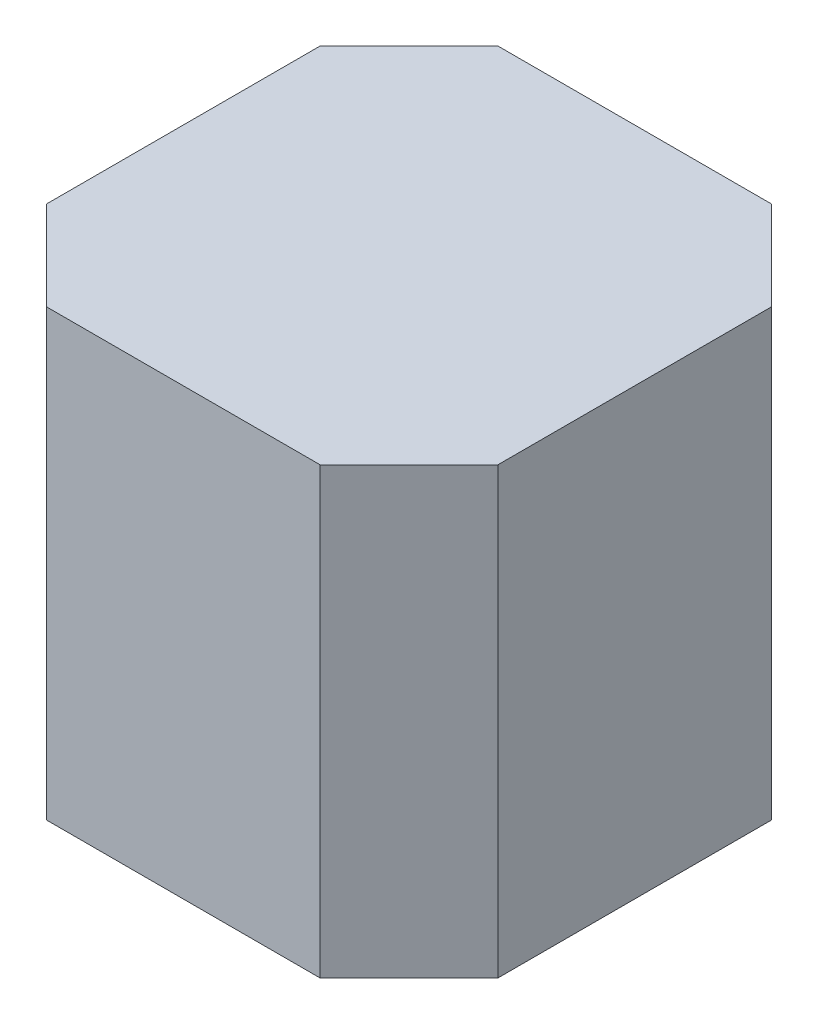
ISO-10303-21;
HEADER;
FILE_DESCRIPTION(('STEP AP214'),'2;1');
FILE_NAME('part.step','',(''),(''),'','','');
FILE_SCHEMA(('AUTOMOTIVE_DESIGN { 1 0 10303 214 1 1 1 1 }'));
ENDSEC;
DATA;
#1=APPLICATION_CONTEXT('core data for automotive mechanical design processes');
#2=APPLICATION_PROTOCOL_DEFINITION('international standard','automotive_design',2000,#1);
#3=PRODUCT_CONTEXT('',#1,'mechanical');
#4=PRODUCT('Part','Part','',(#3));
#5=PRODUCT_RELATED_PRODUCT_CATEGORY('part','',(#4));
#6=PRODUCT_DEFINITION_FORMATION('','',#4);
#7=PRODUCT_DEFINITION_CONTEXT('part definition',#1,'design');
#8=PRODUCT_DEFINITION('design','',#6,#7);
#9=PRODUCT_DEFINITION_SHAPE('','',#8);
#10=(LENGTH_UNIT() NAMED_UNIT(*) SI_UNIT(.MILLI.,.METRE.));
#11=(NAMED_UNIT(*) PLANE_ANGLE_UNIT() SI_UNIT($,.RADIAN.));
#12=(NAMED_UNIT(*) SI_UNIT($,.STERADIAN.) SOLID_ANGLE_UNIT());
#13=UNCERTAINTY_MEASURE_WITH_UNIT(LENGTH_MEASURE(1.E-05),#10,'distance_accuracy_value','');
#14=(GEOMETRIC_REPRESENTATION_CONTEXT(3) GLOBAL_UNCERTAINTY_ASSIGNED_CONTEXT((#13)) GLOBAL_UNIT_ASSIGNED_CONTEXT((#10,
#11,#12)) REPRESENTATION_CONTEXT('',''));
#15=CARTESIAN_POINT('',(0.,0.,0.));
#16=DIRECTION('',(0.,0.,1.));
#17=DIRECTION('',(1.,0.,0.));
#18=AXIS2_PLACEMENT_3D('',#15,#16,#17);
#19=CARTESIAN_POINT('',(1.27,2.5,-1.27));
#20=DIRECTION('',(-1.,0.,0.));
#21=DIRECTION('',(0.,0.,1.));
#22=AXIS2_PLACEMENT_3D('',#19,#20,#21);
#23=PLANE('',#22);
#24=DIRECTION('',(0.,0.,-1.));
#25=VECTOR('',#24,1.);
#26=CARTESIAN_POINT('',(1.27,2.5,-1.27));
#27=LINE('',#26,#25);
#28=CARTESIAN_POINT('',(1.27,2.5,0.77));
#29=VERTEX_POINT('',#28);
#30=CARTESIAN_POINT('',(1.27,2.5,-0.769999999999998));
#31=VERTEX_POINT('',#30);
#32=EDGE_CURVE('E132',#29,#31,#27,.T.);
#33=ORIENTED_EDGE('',*,*,#32,.F.);
#34=DIRECTION('',(0.,-1.,0.));
#35=VECTOR('',#34,1.);
#36=CARTESIAN_POINT('',(1.27,2.5,0.77));
#37=LINE('',#36,#35);
#38=CARTESIAN_POINT('',(1.27,0.,0.77));
#39=VERTEX_POINT('',#38);
#40=EDGE_CURVE('E11',#29,#39,#37,.T.);
#41=ORIENTED_EDGE('',*,*,#40,.T.);
#42=DIRECTION('',(0.,0.,-1.));
#43=VECTOR('',#42,1.);
#44=CARTESIAN_POINT('',(1.27,0.,-1.27));
#45=LINE('',#44,#43);
#46=CARTESIAN_POINT('',(1.27,0.,-0.769999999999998));
#47=VERTEX_POINT('',#46);
#48=EDGE_CURVE('E134',#39,#47,#45,.T.);
#49=ORIENTED_EDGE('',*,*,#48,.T.);
#50=DIRECTION('',(0.,1.,0.));
#51=VECTOR('',#50,1.);
#52=CARTESIAN_POINT('',(1.27,2.5,-0.769999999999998));
#53=LINE('',#52,#51);
#54=EDGE_CURVE('E45',#47,#31,#53,.T.);
#55=ORIENTED_EDGE('',*,*,#54,.T.);
#56=EDGE_LOOP('',(#33,#41,#49,#55));
#57=FACE_BOUND('',#56,.T.);
#58=ADVANCED_FACE('F36',(#57),#23,.F.);
#59=CARTESIAN_POINT('',(-1.27,2.5,-1.27));
#60=DIRECTION('',(0.,0.,1.));
#61=DIRECTION('',(1.,0.,0.));
#62=AXIS2_PLACEMENT_3D('',#59,#60,#61);
#63=PLANE('',#62);
#64=DIRECTION('',(-1.,0.,0.));
#65=VECTOR('',#64,1.);
#66=CARTESIAN_POINT('',(-1.27,0.,-1.27));
#67=LINE('',#66,#65);
#68=CARTESIAN_POINT('',(0.77,0.,-1.27));
#69=VERTEX_POINT('',#68);
#70=CARTESIAN_POINT('',(-0.769999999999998,0.,-1.27));
#71=VERTEX_POINT('',#70);
#72=EDGE_CURVE('E130',#69,#71,#67,.T.);
#73=ORIENTED_EDGE('',*,*,#72,.T.);
#74=DIRECTION('',(0.,1.,0.));
#75=VECTOR('',#74,1.);
#76=CARTESIAN_POINT('',(-0.769999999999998,2.5,-1.27));
#77=LINE('',#76,#75);
#78=CARTESIAN_POINT('',(-0.769999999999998,2.5,-1.27));
#79=VERTEX_POINT('',#78);
#80=EDGE_CURVE('E109',#71,#79,#77,.T.);
#81=ORIENTED_EDGE('',*,*,#80,.T.);
#82=DIRECTION('',(-1.,0.,0.));
#83=VECTOR('',#82,1.);
#84=CARTESIAN_POINT('',(-1.27,2.5,-1.27));
#85=LINE('',#84,#83);
#86=CARTESIAN_POINT('',(0.77,2.5,-1.27));
#87=VERTEX_POINT('',#86);
#88=EDGE_CURVE('E170',#87,#79,#85,.T.);
#89=ORIENTED_EDGE('',*,*,#88,.F.);
#90=DIRECTION('',(0.,-1.,0.));
#91=VECTOR('',#90,1.);
#92=CARTESIAN_POINT('',(0.77,2.5,-1.27));
#93=LINE('',#92,#91);
#94=EDGE_CURVE('E114',#87,#69,#93,.T.);
#95=ORIENTED_EDGE('',*,*,#94,.T.);
#96=EDGE_LOOP('',(#73,#81,#89,#95));
#97=FACE_BOUND('',#96,.T.);
#98=ADVANCED_FACE('F174',(#97),#63,.F.);
#99=CARTESIAN_POINT('',(-1.27,2.5,-1.27));
#100=DIRECTION('',(1.,0.,0.));
#101=DIRECTION('',(0.,0.,-1.));
#102=AXIS2_PLACEMENT_3D('',#99,#100,#101);
#103=PLANE('',#102);
#104=DIRECTION('',(0.,0.,1.));
#105=VECTOR('',#104,1.);
#106=CARTESIAN_POINT('',(-1.27,2.5,-1.27));
#107=LINE('',#106,#105);
#108=CARTESIAN_POINT('',(-1.27,2.5,-0.77));
#109=VERTEX_POINT('',#108);
#110=CARTESIAN_POINT('',(-1.27,2.5,0.769999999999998));
#111=VERTEX_POINT('',#110);
#112=EDGE_CURVE('E123',#109,#111,#107,.T.);
#113=ORIENTED_EDGE('',*,*,#112,.F.);
#114=DIRECTION('',(0.,-1.,0.));
#115=VECTOR('',#114,1.);
#116=CARTESIAN_POINT('',(-1.27,2.5,-0.77));
#117=LINE('',#116,#115);
#118=CARTESIAN_POINT('',(-1.27,0.,-0.77));
#119=VERTEX_POINT('',#118);
#120=EDGE_CURVE('E108',#109,#119,#117,.T.);
#121=ORIENTED_EDGE('',*,*,#120,.T.);
#122=DIRECTION('',(0.,0.,1.));
#123=VECTOR('',#122,1.);
#124=CARTESIAN_POINT('',(-1.27,0.,-1.27));
#125=LINE('',#124,#123);
#126=CARTESIAN_POINT('',(-1.27,0.,0.769999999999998));
#127=VERTEX_POINT('',#126);
#128=EDGE_CURVE('E121',#119,#127,#125,.T.);
#129=ORIENTED_EDGE('',*,*,#128,.T.);
#130=DIRECTION('',(0.,1.,0.));
#131=VECTOR('',#130,1.);
#132=CARTESIAN_POINT('',(-1.27,2.5,0.769999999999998));
#133=LINE('',#132,#131);
#134=EDGE_CURVE('E125',#127,#111,#133,.T.);
#135=ORIENTED_EDGE('',*,*,#134,.T.);
#136=EDGE_LOOP('',(#113,#121,#129,#135));
#137=FACE_BOUND('',#136,.T.);
#138=ADVANCED_FACE('F120',(#137),#103,.F.);
#139=CARTESIAN_POINT('',(-1.27,2.5,1.27));
#140=DIRECTION('',(0.,0.,-1.));
#141=DIRECTION('',(-1.,0.,0.));
#142=AXIS2_PLACEMENT_3D('',#139,#140,#141);
#143=PLANE('',#142);
#144=DIRECTION('',(1.,0.,0.));
#145=VECTOR('',#144,1.);
#146=CARTESIAN_POINT('',(-1.27,2.5,1.27));
#147=LINE('',#146,#145);
#148=CARTESIAN_POINT('',(-0.77,2.5,1.27));
#149=VERTEX_POINT('',#148);
#150=CARTESIAN_POINT('',(0.769999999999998,2.5,1.27));
#151=VERTEX_POINT('',#150);
#152=EDGE_CURVE('E138',#149,#151,#147,.T.);
#153=ORIENTED_EDGE('',*,*,#152,.F.);
#154=DIRECTION('',(0.,-1.,0.));
#155=VECTOR('',#154,1.);
#156=CARTESIAN_POINT('',(-0.77,2.5,1.27));
#157=LINE('',#156,#155);
#158=CARTESIAN_POINT('',(-0.77,0.,1.27));
#159=VERTEX_POINT('',#158);
#160=EDGE_CURVE('E155',#149,#159,#157,.T.);
#161=ORIENTED_EDGE('',*,*,#160,.T.);
#162=DIRECTION('',(1.,0.,0.));
#163=VECTOR('',#162,1.);
#164=CARTESIAN_POINT('',(-1.27,0.,1.27));
#165=LINE('',#164,#163);
#166=CARTESIAN_POINT('',(0.769999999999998,0.,1.27));
#167=VERTEX_POINT('',#166);
#168=EDGE_CURVE('E129',#159,#167,#165,.T.);
#169=ORIENTED_EDGE('',*,*,#168,.T.);
#170=DIRECTION('',(0.,1.,0.));
#171=VECTOR('',#170,1.);
#172=CARTESIAN_POINT('',(0.769999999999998,2.5,1.27));
#173=LINE('',#172,#171);
#174=EDGE_CURVE('E52',#167,#151,#173,.T.);
#175=ORIENTED_EDGE('',*,*,#174,.T.);
#176=EDGE_LOOP('',(#153,#161,#169,#175));
#177=FACE_BOUND('',#176,.T.);
#178=ADVANCED_FACE('F181',(#177),#143,.F.);
#179=CARTESIAN_POINT('',(0.,2.5,0.));
#180=DIRECTION('',(0.,1.,0.));
#181=DIRECTION('',(0.,0.,1.));
#182=AXIS2_PLACEMENT_3D('',#179,#180,#181);
#183=PLANE('',#182);
#184=ORIENTED_EDGE('',*,*,#88,.T.);
#185=DIRECTION('',(0.707106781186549,0.,-0.707106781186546));
#186=VECTOR('',#185,1.);
#187=CARTESIAN_POINT('',(-1.02,2.5,-1.02));
#188=LINE('',#187,#186);
#189=EDGE_CURVE('E152',#79,#109,#188,.F.);
#190=ORIENTED_EDGE('',*,*,#189,.T.);
#191=ORIENTED_EDGE('',*,*,#112,.T.);
#192=DIRECTION('',(-0.707106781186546,0.,-0.707106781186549));
#193=VECTOR('',#192,1.);
#194=CARTESIAN_POINT('',(-1.02,2.5,1.02));
#195=LINE('',#194,#193);
#196=EDGE_CURVE('E59',#111,#149,#195,.F.);
#197=ORIENTED_EDGE('',*,*,#196,.T.);
#198=ORIENTED_EDGE('',*,*,#152,.T.);
#199=DIRECTION('',(-0.707106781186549,0.,0.707106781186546));
#200=VECTOR('',#199,1.);
#201=CARTESIAN_POINT('',(1.02,2.5,1.02));
#202=LINE('',#201,#200);
#203=EDGE_CURVE('E149',#151,#29,#202,.F.);
#204=ORIENTED_EDGE('',*,*,#203,.T.);
#205=ORIENTED_EDGE('',*,*,#32,.T.);
#206=DIRECTION('',(0.707106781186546,0.,0.707106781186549));
#207=VECTOR('',#206,1.);
#208=CARTESIAN_POINT('',(1.02,2.5,-1.02));
#209=LINE('',#208,#207);
#210=EDGE_CURVE('E147',#31,#87,#209,.F.);
#211=ORIENTED_EDGE('',*,*,#210,.T.);
#212=EDGE_LOOP('',(#184,#190,#191,#197,#198,#204,#205,#211));
#213=FACE_BOUND('',#212,.T.);
#214=ADVANCED_FACE('F167',(#213),#183,.T.);
#215=CARTESIAN_POINT('',(0.,0.,0.));
#216=DIRECTION('',(0.,1.,0.));
#217=DIRECTION('',(0.,0.,1.));
#218=AXIS2_PLACEMENT_3D('',#215,#216,#217);
#219=PLANE('',#218);
#220=ORIENTED_EDGE('',*,*,#128,.F.);
#221=DIRECTION('',(-0.707106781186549,0.,0.707106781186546));
#222=VECTOR('',#221,1.);
#223=CARTESIAN_POINT('',(-1.27,0.,-0.77));
#224=LINE('',#223,#222);
#225=EDGE_CURVE('E104',#119,#71,#224,.F.);
#226=ORIENTED_EDGE('',*,*,#225,.T.);
#227=ORIENTED_EDGE('',*,*,#72,.F.);
#228=DIRECTION('',(-0.707106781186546,0.,-0.707106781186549));
#229=VECTOR('',#228,1.);
#230=CARTESIAN_POINT('',(0.77,0.,-1.27));
#231=LINE('',#230,#229);
#232=EDGE_CURVE('E124',#69,#47,#231,.F.);
#233=ORIENTED_EDGE('',*,*,#232,.T.);
#234=ORIENTED_EDGE('',*,*,#48,.F.);
#235=DIRECTION('',(0.707106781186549,0.,-0.707106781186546));
#236=VECTOR('',#235,1.);
#237=CARTESIAN_POINT('',(1.27,0.,0.77));
#238=LINE('',#237,#236);
#239=EDGE_CURVE('E141',#39,#167,#238,.F.);
#240=ORIENTED_EDGE('',*,*,#239,.T.);
#241=ORIENTED_EDGE('',*,*,#168,.F.);
#242=DIRECTION('',(0.707106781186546,0.,0.707106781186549));
#243=VECTOR('',#242,1.);
#244=CARTESIAN_POINT('',(-0.77,0.,1.27));
#245=LINE('',#244,#243);
#246=EDGE_CURVE('E115',#159,#127,#245,.F.);
#247=ORIENTED_EDGE('',*,*,#246,.T.);
#248=EDGE_LOOP('',(#220,#226,#227,#233,#234,#240,#241,#247));
#249=FACE_BOUND('',#248,.T.);
#250=ADVANCED_FACE('F127',(#249),#219,.F.);
#251=CARTESIAN_POINT('',(-1.27,2.5,-0.77));
#252=DIRECTION('',(0.707106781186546,0.,0.707106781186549));
#253=DIRECTION('',(0.,-1.,0.));
#254=AXIS2_PLACEMENT_3D('',#251,#252,#253);
#255=PLANE('',#254);
#256=ORIENTED_EDGE('',*,*,#189,.F.);
#257=ORIENTED_EDGE('',*,*,#80,.F.);
#258=ORIENTED_EDGE('',*,*,#225,.F.);
#259=ORIENTED_EDGE('',*,*,#120,.F.);
#260=EDGE_LOOP('',(#256,#257,#258,#259));
#261=FACE_BOUND('',#260,.T.);
#262=ADVANCED_FACE('F107',(#261),#255,.F.);
#263=CARTESIAN_POINT('',(-0.77,2.5,1.27));
#264=DIRECTION('',(0.707106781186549,0.,-0.707106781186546));
#265=DIRECTION('',(0.,-1.,0.));
#266=AXIS2_PLACEMENT_3D('',#263,#264,#265);
#267=PLANE('',#266);
#268=ORIENTED_EDGE('',*,*,#196,.F.);
#269=ORIENTED_EDGE('',*,*,#134,.F.);
#270=ORIENTED_EDGE('',*,*,#246,.F.);
#271=ORIENTED_EDGE('',*,*,#160,.F.);
#272=EDGE_LOOP('',(#268,#269,#270,#271));
#273=FACE_BOUND('',#272,.T.);
#274=ADVANCED_FACE('F180',(#273),#267,.F.);
#275=CARTESIAN_POINT('',(1.27,2.5,0.77));
#276=DIRECTION('',(-0.707106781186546,0.,-0.707106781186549));
#277=DIRECTION('',(0.,-1.,0.));
#278=AXIS2_PLACEMENT_3D('',#275,#276,#277);
#279=PLANE('',#278);
#280=ORIENTED_EDGE('',*,*,#203,.F.);
#281=ORIENTED_EDGE('',*,*,#174,.F.);
#282=ORIENTED_EDGE('',*,*,#239,.F.);
#283=ORIENTED_EDGE('',*,*,#40,.F.);
#284=EDGE_LOOP('',(#280,#281,#282,#283));
#285=FACE_BOUND('',#284,.T.);
#286=ADVANCED_FACE('F183',(#285),#279,.F.);
#287=CARTESIAN_POINT('',(0.77,2.5,-1.27));
#288=DIRECTION('',(-0.707106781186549,0.,0.707106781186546));
#289=DIRECTION('',(0.,-1.,0.));
#290=AXIS2_PLACEMENT_3D('',#287,#288,#289);
#291=PLANE('',#290);
#292=ORIENTED_EDGE('',*,*,#210,.F.);
#293=ORIENTED_EDGE('',*,*,#54,.F.);
#294=ORIENTED_EDGE('',*,*,#232,.F.);
#295=ORIENTED_EDGE('',*,*,#94,.F.);
#296=EDGE_LOOP('',(#292,#293,#294,#295));
#297=FACE_BOUND('',#296,.T.);
#298=ADVANCED_FACE('F39',(#297),#291,.F.);
#299=CLOSED_SHELL('',(#58,#98,#138,#178,#214,#250,#262,#274,#286,#298));
#300=MANIFOLD_SOLID_BREP('B2',#299);
#301=ADVANCED_BREP_SHAPE_REPRESENTATION('',(#18,#300),#14);
#302=SHAPE_DEFINITION_REPRESENTATION(#9,#301);
ENDSEC;
END-ISO-10303-21;
